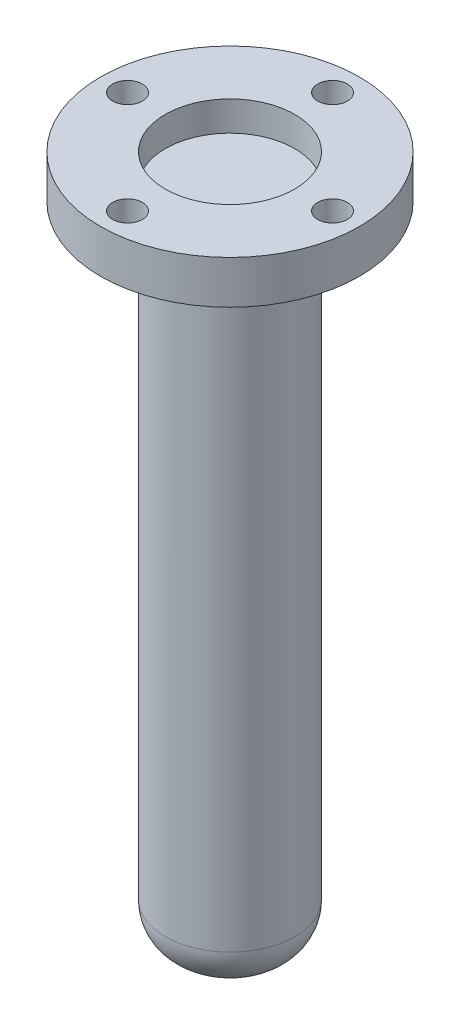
ISO-10303-21;
HEADER;
FILE_DESCRIPTION(('STEP AP214'),'2;1');
FILE_NAME('part.step','',(''),(''),'','','');
FILE_SCHEMA(('AUTOMOTIVE_DESIGN { 1 0 10303 214 1 1 1 1 }'));
ENDSEC;
DATA;
#1=APPLICATION_CONTEXT('core data for automotive mechanical design processes');
#2=APPLICATION_PROTOCOL_DEFINITION('international standard','automotive_design',2000,#1);
#3=PRODUCT_CONTEXT('',#1,'mechanical');
#4=PRODUCT('Part','Part','',(#3));
#5=PRODUCT_RELATED_PRODUCT_CATEGORY('part','',(#4));
#6=PRODUCT_DEFINITION_FORMATION('','',#4);
#7=PRODUCT_DEFINITION_CONTEXT('part definition',#1,'design');
#8=PRODUCT_DEFINITION('design','',#6,#7);
#9=PRODUCT_DEFINITION_SHAPE('','',#8);
#10=(LENGTH_UNIT() NAMED_UNIT(*) SI_UNIT(.MILLI.,.METRE.));
#11=(NAMED_UNIT(*) PLANE_ANGLE_UNIT() SI_UNIT($,.RADIAN.));
#12=(NAMED_UNIT(*) SI_UNIT($,.STERADIAN.) SOLID_ANGLE_UNIT());
#13=UNCERTAINTY_MEASURE_WITH_UNIT(LENGTH_MEASURE(1.E-05),#10,'distance_accuracy_value','');
#14=(GEOMETRIC_REPRESENTATION_CONTEXT(3) GLOBAL_UNCERTAINTY_ASSIGNED_CONTEXT((#13)) GLOBAL_UNIT_ASSIGNED_CONTEXT((#10,
#11,#12)) REPRESENTATION_CONTEXT('',''));
#15=CARTESIAN_POINT('',(0.,0.,0.));
#16=DIRECTION('',(0.,0.,1.));
#17=DIRECTION('',(1.,0.,0.));
#18=AXIS2_PLACEMENT_3D('',#15,#16,#17);
#19=CARTESIAN_POINT('',(0.,8.,0.));
#20=DIRECTION('',(0.,-1.,0.));
#21=DIRECTION('',(0.,0.,-1.));
#22=AXIS2_PLACEMENT_3D('',#19,#20,#21);
#23=CYLINDRICAL_SURFACE('',#22,24.);
#24=CARTESIAN_POINT('',(0.,8.,0.));
#25=DIRECTION('',(0.,1.,0.));
#26=DIRECTION('',(0.,0.,1.));
#27=AXIS2_PLACEMENT_3D('',#24,#25,#26);
#28=CIRCLE('',#27,24.);
#29=CARTESIAN_POINT('',(0.,8.,24.));
#30=VERTEX_POINT('',#29);
#31=EDGE_CURVE('E46',#30,#30,#28,.T.);
#32=ORIENTED_EDGE('',*,*,#31,.F.);
#33=EDGE_LOOP('',(#32));
#34=FACE_BOUND('',#33,.T.);
#35=CARTESIAN_POINT('',(0.,0.,0.));
#36=DIRECTION('',(0.,1.,0.));
#37=DIRECTION('',(0.,0.,1.));
#38=AXIS2_PLACEMENT_3D('',#35,#36,#37);
#39=CIRCLE('',#38,24.);
#40=CARTESIAN_POINT('',(0.,0.,24.));
#41=VERTEX_POINT('',#40);
#42=EDGE_CURVE('E49',#41,#41,#39,.T.);
#43=ORIENTED_EDGE('',*,*,#42,.T.);
#44=EDGE_LOOP('',(#43));
#45=FACE_BOUND('',#44,.T.);
#46=ADVANCED_FACE('F31',(#34,#45),#23,.T.);
#47=CARTESIAN_POINT('',(0.,8.,0.));
#48=DIRECTION('',(0.,1.,0.));
#49=DIRECTION('',(0.,0.,1.));
#50=AXIS2_PLACEMENT_3D('',#47,#48,#49);
#51=PLANE('',#50);
#52=CARTESIAN_POINT('',(1.99014436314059E-13,8.,-19.));
#53=DIRECTION('',(0.,1.,0.));
#54=DIRECTION('',(0.,0.,1.));
#55=AXIS2_PLACEMENT_3D('',#52,#53,#54);
#56=CIRCLE('',#55,2.75);
#57=CARTESIAN_POINT('',(1.99014436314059E-13,8.,-16.25));
#58=VERTEX_POINT('',#57);
#59=EDGE_CURVE('E79',#58,#58,#56,.T.);
#60=ORIENTED_EDGE('',*,*,#59,.F.);
#61=EDGE_LOOP('',(#60));
#62=FACE_BOUND('',#61,.T.);
#63=CARTESIAN_POINT('',(-19.,8.,-1.32676290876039E-13));
#64=DIRECTION('',(0.,1.,0.));
#65=DIRECTION('',(0.,0.,1.));
#66=AXIS2_PLACEMENT_3D('',#63,#64,#65);
#67=CIRCLE('',#66,2.75);
#68=CARTESIAN_POINT('',(-19.,8.,2.74999999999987));
#69=VERTEX_POINT('',#68);
#70=EDGE_CURVE('E73',#69,#69,#67,.T.);
#71=ORIENTED_EDGE('',*,*,#70,.F.);
#72=EDGE_LOOP('',(#71));
#73=FACE_BOUND('',#72,.T.);
#74=CARTESIAN_POINT('',(0.,8.,19.));
#75=DIRECTION('',(0.,1.,0.));
#76=DIRECTION('',(0.,0.,1.));
#77=AXIS2_PLACEMENT_3D('',#74,#75,#76);
#78=CIRCLE('',#77,2.75);
#79=CARTESIAN_POINT('',(0.,8.,21.75));
#80=VERTEX_POINT('',#79);
#81=EDGE_CURVE('E67',#80,#80,#78,.T.);
#82=ORIENTED_EDGE('',*,*,#81,.F.);
#83=EDGE_LOOP('',(#82));
#84=FACE_BOUND('',#83,.T.);
#85=CARTESIAN_POINT('',(19.,8.,0.));
#86=DIRECTION('',(0.,1.,0.));
#87=DIRECTION('',(0.,0.,1.));
#88=AXIS2_PLACEMENT_3D('',#85,#86,#87);
#89=CIRCLE('',#88,2.75);
#90=CARTESIAN_POINT('',(19.,8.,2.75));
#91=VERTEX_POINT('',#90);
#92=EDGE_CURVE('E61',#91,#91,#89,.T.);
#93=ORIENTED_EDGE('',*,*,#92,.F.);
#94=EDGE_LOOP('',(#93));
#95=FACE_BOUND('',#94,.T.);
#96=CARTESIAN_POINT('',(0.,8.,0.));
#97=DIRECTION('',(0.,1.,0.));
#98=DIRECTION('',(0.,0.,1.));
#99=AXIS2_PLACEMENT_3D('',#96,#97,#98);
#100=CIRCLE('',#99,12.);
#101=CARTESIAN_POINT('',(0.,8.,12.));
#102=VERTEX_POINT('',#101);
#103=EDGE_CURVE('E55',#102,#102,#100,.T.);
#104=ORIENTED_EDGE('',*,*,#103,.F.);
#105=EDGE_LOOP('',(#104));
#106=FACE_BOUND('',#105,.T.);
#107=ORIENTED_EDGE('',*,*,#31,.T.);
#108=EDGE_LOOP('',(#107));
#109=FACE_BOUND('',#108,.T.);
#110=ADVANCED_FACE('F94',(#62,#73,#84,#95,#106,#109),#51,.T.);
#111=CARTESIAN_POINT('',(0.,0.,0.));
#112=DIRECTION('',(0.,1.,0.));
#113=DIRECTION('',(0.,0.,1.));
#114=AXIS2_PLACEMENT_3D('',#111,#112,#113);
#115=PLANE('',#114);
#116=CARTESIAN_POINT('',(0.,0.,0.));
#117=DIRECTION('',(0.,1.,0.));
#118=DIRECTION('',(0.,0.,1.));
#119=AXIS2_PLACEMENT_3D('',#116,#117,#118);
#120=CIRCLE('',#119,12.);
#121=CARTESIAN_POINT('',(0.,0.,12.));
#122=VERTEX_POINT('',#121);
#123=EDGE_CURVE('E42',#122,#122,#120,.F.);
#124=ORIENTED_EDGE('',*,*,#123,.F.);
#125=EDGE_LOOP('',(#124));
#126=FACE_BOUND('',#125,.T.);
#127=ORIENTED_EDGE('',*,*,#42,.F.);
#128=EDGE_LOOP('',(#127));
#129=FACE_BOUND('',#128,.T.);
#130=ADVANCED_FACE('F97',(#126,#129),#115,.F.);
#131=CARTESIAN_POINT('',(0.,-120.,0.));
#132=DIRECTION('',(0.,1.,0.));
#133=DIRECTION('',(-1.,0.,0.));
#134=AXIS2_PLACEMENT_3D('',#131,#132,#133);
#135=PLANE('',#134);
#136=CARTESIAN_POINT('',(0.,-120.,0.));
#137=DIRECTION('',(0.,1.,0.));
#138=DIRECTION('',(-1.,0.,0.));
#139=AXIS2_PLACEMENT_3D('',#136,#137,#138);
#140=CIRCLE('',#139,4.);
#141=CARTESIAN_POINT('',(-3.99999999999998,-120.,0.));
#142=VERTEX_POINT('',#141);
#143=EDGE_CURVE('E10',#142,#142,#140,.F.);
#144=ORIENTED_EDGE('',*,*,#143,.T.);
#145=EDGE_LOOP('',(#144));
#146=FACE_BOUND('',#145,.T.);
#147=ADVANCED_FACE('F114',(#146),#135,.F.);
#148=CARTESIAN_POINT('',(0.,0.,0.));
#149=DIRECTION('',(0.,1.,0.));
#150=DIRECTION('',(-1.,0.,0.));
#151=AXIS2_PLACEMENT_3D('',#148,#149,#150);
#152=CYLINDRICAL_SURFACE('',#151,12.);
#153=CARTESIAN_POINT('',(0.,-112.,0.));
#154=DIRECTION('',(0.,1.,0.));
#155=DIRECTION('',(-1.,0.,0.));
#156=AXIS2_PLACEMENT_3D('',#153,#154,#155);
#157=CIRCLE('',#156,12.);
#158=CARTESIAN_POINT('',(-12.,-112.,0.));
#159=VERTEX_POINT('',#158);
#160=EDGE_CURVE('E38',#159,#159,#157,.T.);
#161=ORIENTED_EDGE('',*,*,#160,.T.);
#162=EDGE_LOOP('',(#161));
#163=FACE_BOUND('',#162,.T.);
#164=ORIENTED_EDGE('',*,*,#123,.T.);
#165=EDGE_LOOP('',(#164));
#166=FACE_BOUND('',#165,.T.);
#167=ADVANCED_FACE('F120',(#163,#166),#152,.T.);
#168=CARTESIAN_POINT('',(0.,-112.,0.));
#169=DIRECTION('',(0.,1.,0.));
#170=DIRECTION('',(-1.,0.,0.));
#171=AXIS2_PLACEMENT_3D('',#168,#169,#170);
#172=DEGENERATE_TOROIDAL_SURFACE('',#171,4.,8.,.T.);
#173=ORIENTED_EDGE('',*,*,#143,.F.);
#174=EDGE_LOOP('',(#173));
#175=FACE_BOUND('',#174,.T.);
#176=ORIENTED_EDGE('',*,*,#160,.F.);
#177=EDGE_LOOP('',(#176));
#178=FACE_BOUND('',#177,.T.);
#179=ADVANCED_FACE('F33',(#175,#178),#172,.T.);
#180=CARTESIAN_POINT('',(0.,2.5,0.));
#181=DIRECTION('',(0.,1.,0.));
#182=DIRECTION('',(0.,0.,1.));
#183=AXIS2_PLACEMENT_3D('',#180,#181,#182);
#184=CYLINDRICAL_SURFACE('',#183,12.);
#185=CARTESIAN_POINT('',(0.,2.5,0.));
#186=DIRECTION('',(0.,1.,0.));
#187=DIRECTION('',(0.,0.,1.));
#188=AXIS2_PLACEMENT_3D('',#185,#186,#187);
#189=CIRCLE('',#188,12.);
#190=CARTESIAN_POINT('',(0.,2.5,12.));
#191=VERTEX_POINT('',#190);
#192=EDGE_CURVE('E52',#191,#191,#189,.T.);
#193=ORIENTED_EDGE('',*,*,#192,.F.);
#194=EDGE_LOOP('',(#193));
#195=FACE_BOUND('',#194,.T.);
#196=ORIENTED_EDGE('',*,*,#103,.T.);
#197=EDGE_LOOP('',(#196));
#198=FACE_BOUND('',#197,.T.);
#199=ADVANCED_FACE('F126',(#195,#198),#184,.F.);
#200=CARTESIAN_POINT('',(0.,2.5,0.));
#201=DIRECTION('',(0.,1.,0.));
#202=DIRECTION('',(0.,0.,1.));
#203=AXIS2_PLACEMENT_3D('',#200,#201,#202);
#204=PLANE('',#203);
#205=ORIENTED_EDGE('',*,*,#192,.T.);
#206=EDGE_LOOP('',(#205));
#207=FACE_BOUND('',#206,.T.);
#208=ADVANCED_FACE('F129',(#207),#204,.T.);
#209=CARTESIAN_POINT('',(19.,2.5,0.));
#210=DIRECTION('',(0.,1.,0.));
#211=DIRECTION('',(0.,0.,1.));
#212=AXIS2_PLACEMENT_3D('',#209,#210,#211);
#213=CYLINDRICAL_SURFACE('',#212,2.75);
#214=CARTESIAN_POINT('',(19.,2.5,0.));
#215=DIRECTION('',(0.,1.,0.));
#216=DIRECTION('',(0.,0.,1.));
#217=AXIS2_PLACEMENT_3D('',#214,#215,#216);
#218=CIRCLE('',#217,2.75);
#219=CARTESIAN_POINT('',(19.,2.5,2.75));
#220=VERTEX_POINT('',#219);
#221=EDGE_CURVE('E58',#220,#220,#218,.T.);
#222=ORIENTED_EDGE('',*,*,#221,.F.);
#223=EDGE_LOOP('',(#222));
#224=FACE_BOUND('',#223,.T.);
#225=ORIENTED_EDGE('',*,*,#92,.T.);
#226=EDGE_LOOP('',(#225));
#227=FACE_BOUND('',#226,.T.);
#228=ADVANCED_FACE('F133',(#224,#227),#213,.F.);
#229=CARTESIAN_POINT('',(19.,2.5,0.));
#230=DIRECTION('',(0.,1.,0.));
#231=DIRECTION('',(0.,0.,1.));
#232=AXIS2_PLACEMENT_3D('',#229,#230,#231);
#233=PLANE('',#232);
#234=ORIENTED_EDGE('',*,*,#221,.T.);
#235=EDGE_LOOP('',(#234));
#236=FACE_BOUND('',#235,.T.);
#237=ADVANCED_FACE('F137',(#236),#233,.T.);
#238=CARTESIAN_POINT('',(0.,2.5,19.));
#239=DIRECTION('',(0.,1.,0.));
#240=DIRECTION('',(0.,0.,1.));
#241=AXIS2_PLACEMENT_3D('',#238,#239,#240);
#242=CYLINDRICAL_SURFACE('',#241,2.75);
#243=CARTESIAN_POINT('',(0.,2.5,19.));
#244=DIRECTION('',(0.,1.,0.));
#245=DIRECTION('',(0.,0.,1.));
#246=AXIS2_PLACEMENT_3D('',#243,#244,#245);
#247=CIRCLE('',#246,2.75);
#248=CARTESIAN_POINT('',(0.,2.5,21.75));
#249=VERTEX_POINT('',#248);
#250=EDGE_CURVE('E64',#249,#249,#247,.T.);
#251=ORIENTED_EDGE('',*,*,#250,.F.);
#252=EDGE_LOOP('',(#251));
#253=FACE_BOUND('',#252,.T.);
#254=ORIENTED_EDGE('',*,*,#81,.T.);
#255=EDGE_LOOP('',(#254));
#256=FACE_BOUND('',#255,.T.);
#257=ADVANCED_FACE('F141',(#253,#256),#242,.F.);
#258=CARTESIAN_POINT('',(0.,2.5,19.));
#259=DIRECTION('',(0.,1.,0.));
#260=DIRECTION('',(0.,0.,1.));
#261=AXIS2_PLACEMENT_3D('',#258,#259,#260);
#262=PLANE('',#261);
#263=ORIENTED_EDGE('',*,*,#250,.T.);
#264=EDGE_LOOP('',(#263));
#265=FACE_BOUND('',#264,.T.);
#266=ADVANCED_FACE('F145',(#265),#262,.T.);
#267=CARTESIAN_POINT('',(-19.,2.5,-1.32676290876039E-13));
#268=DIRECTION('',(0.,1.,0.));
#269=DIRECTION('',(0.,0.,1.));
#270=AXIS2_PLACEMENT_3D('',#267,#268,#269);
#271=CYLINDRICAL_SURFACE('',#270,2.75);
#272=CARTESIAN_POINT('',(-19.,2.5,-1.32676290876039E-13));
#273=DIRECTION('',(0.,1.,0.));
#274=DIRECTION('',(0.,0.,1.));
#275=AXIS2_PLACEMENT_3D('',#272,#273,#274);
#276=CIRCLE('',#275,2.75);
#277=CARTESIAN_POINT('',(-19.,2.5,2.74999999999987));
#278=VERTEX_POINT('',#277);
#279=EDGE_CURVE('E70',#278,#278,#276,.T.);
#280=ORIENTED_EDGE('',*,*,#279,.F.);
#281=EDGE_LOOP('',(#280));
#282=FACE_BOUND('',#281,.T.);
#283=ORIENTED_EDGE('',*,*,#70,.T.);
#284=EDGE_LOOP('',(#283));
#285=FACE_BOUND('',#284,.T.);
#286=ADVANCED_FACE('F149',(#282,#285),#271,.F.);
#287=CARTESIAN_POINT('',(-19.,2.5,-1.32676290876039E-13));
#288=DIRECTION('',(0.,1.,0.));
#289=DIRECTION('',(0.,0.,1.));
#290=AXIS2_PLACEMENT_3D('',#287,#288,#289);
#291=PLANE('',#290);
#292=ORIENTED_EDGE('',*,*,#279,.T.);
#293=EDGE_LOOP('',(#292));
#294=FACE_BOUND('',#293,.T.);
#295=ADVANCED_FACE('F90',(#294),#291,.T.);
#296=CARTESIAN_POINT('',(1.99014436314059E-13,2.5,-19.));
#297=DIRECTION('',(0.,1.,0.));
#298=DIRECTION('',(0.,0.,1.));
#299=AXIS2_PLACEMENT_3D('',#296,#297,#298);
#300=CYLINDRICAL_SURFACE('',#299,2.75);
#301=CARTESIAN_POINT('',(1.99014436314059E-13,2.5,-19.));
#302=DIRECTION('',(0.,1.,0.));
#303=DIRECTION('',(0.,0.,1.));
#304=AXIS2_PLACEMENT_3D('',#301,#302,#303);
#305=CIRCLE('',#304,2.75);
#306=CARTESIAN_POINT('',(1.99014436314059E-13,2.5,-16.25));
#307=VERTEX_POINT('',#306);
#308=EDGE_CURVE('E76',#307,#307,#305,.T.);
#309=ORIENTED_EDGE('',*,*,#308,.F.);
#310=EDGE_LOOP('',(#309));
#311=FACE_BOUND('',#310,.T.);
#312=ORIENTED_EDGE('',*,*,#59,.T.);
#313=EDGE_LOOP('',(#312));
#314=FACE_BOUND('',#313,.T.);
#315=ADVANCED_FACE('F87',(#311,#314),#300,.F.);
#316=CARTESIAN_POINT('',(1.99014436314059E-13,2.5,-19.));
#317=DIRECTION('',(0.,1.,0.));
#318=DIRECTION('',(0.,0.,1.));
#319=AXIS2_PLACEMENT_3D('',#316,#317,#318);
#320=PLANE('',#319);
#321=ORIENTED_EDGE('',*,*,#308,.T.);
#322=EDGE_LOOP('',(#321));
#323=FACE_BOUND('',#322,.T.);
#324=ADVANCED_FACE('F85',(#323),#320,.T.);
#325=CLOSED_SHELL('',(#46,#110,#130,#147,#167,#179,#199,#208,#228,#237,#257,#266,#286,#295,#315,#324));
#326=MANIFOLD_SOLID_BREP('B2',#325);
#327=ADVANCED_BREP_SHAPE_REPRESENTATION('',(#18,#326),#14);
#328=SHAPE_DEFINITION_REPRESENTATION(#9,#327);
ENDSEC;
END-ISO-10303-21;
